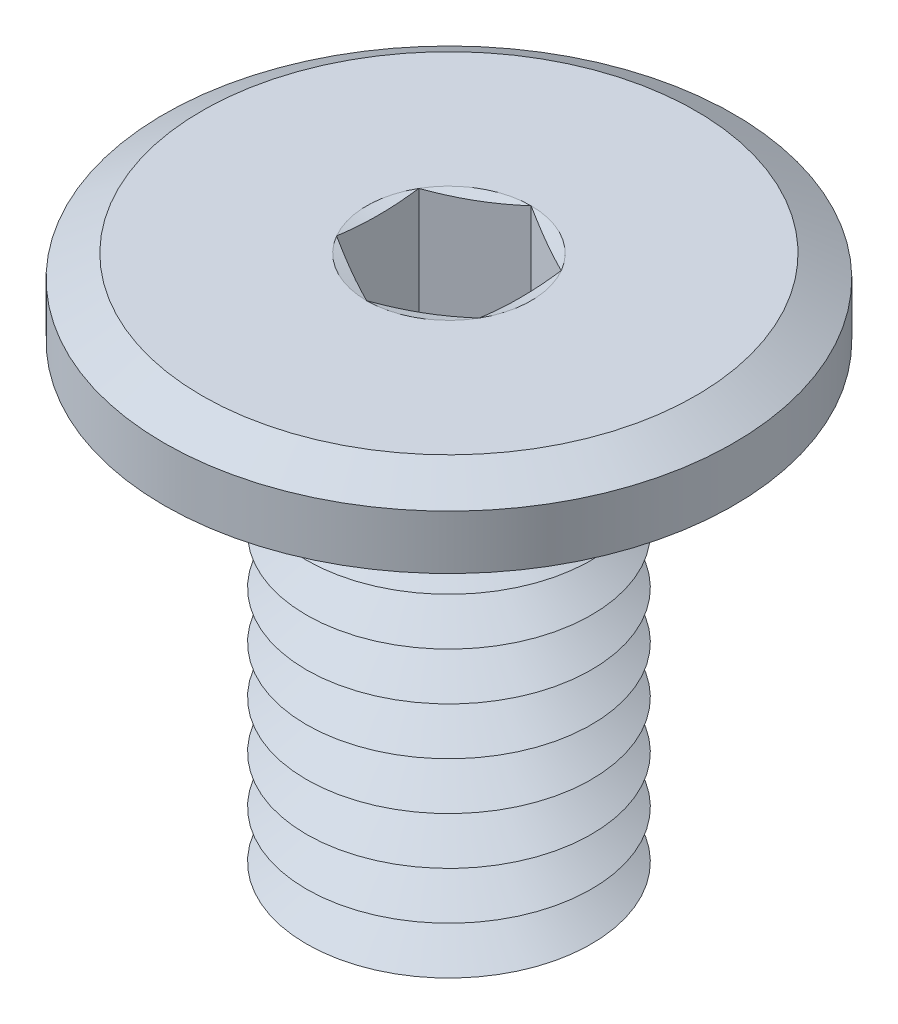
from build123d import *

# Parameters (mm, degrees)
SKETCH1_R           = 3
BOSS_EXTRUDE1_DEPTH = 0.8
SKETCH2_R           = 1.5
BOSS_EXTRUDE2_DEPTH = 5
LPATTERN1_COUNT     = 9
LPATTERN1_PITCH     = 0.5
FILLET1_R           = 0.1
CHAMFER2_SIZE       = 0.4
CHAMFER2_SIZE2      = 0.230940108
CUT_EXTRUDE1_DEPTH  = 1.4


with BuildPart() as part:
    # Sketch1 → Boss-Extrude1 (new body)
    with BuildSketch(Plane(origin=(0, 0, 0), x_dir=(1, 0, 0), z_dir=(0, 1, 0))):
        with Locations(Location((0, 0, 0), (0, 0, 270))):
            Circle(SKETCH1_R)
    extrude(amount=-BOSS_EXTRUDE1_DEPTH)

    # Sketch2 → Boss-Extrude2 (add)
    with BuildSketch(Plane.XZ.offset(0.8)):
        with Locations(Location((0, 0, 0), (0, 0, 270))):
            Circle(SKETCH2_R)
    extrude(amount=BOSS_EXTRUDE2_DEPTH)

    # Sketch5 → Cut-Revolve1 (revolve, cut)
    with BuildSketch(Plane(origin=(0, 0, 0), x_dir=(0, 0, -1), z_dir=(1, 0, 0))):
        Polygon((-1.5, -6.05), (-1.066987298, -5.8), (-1.5, -5.55), align=None)
    cut_revolve1 = revolve(axis=Axis((0, 0.990593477, 0), (0, -1, 0)), mode=Mode.SUBTRACT)

    # LPattern1: Cut-Revolve1 ×9
    with Locations(*[(0, i * LPATTERN1_PITCH, 0) for i in range(1, LPATTERN1_COUNT)]):
        add(cut_revolve1, mode=Mode.SUBTRACT)

    # Fillet1
    fillet1_edges = [part.edges().sort_by_distance(p)[0] for p in [
        (0, -0.8, 1.5),
    ]]
    fillet(fillet1_edges, radius=FILLET1_R)

    # Chamfer2
    chamfer2_edges = [part.edges().sort_by_distance(p)[0] for p in [
        (0, 0, -3),
    ]]
    chamfer2_side = [part.faces().sort_by_distance(p)[0] for p in [
        (0, 0, 0),
    ]]
    chamfer(chamfer2_edges, length=CHAMFER2_SIZE, length2=CHAMFER2_SIZE2, reference=chamfer2_side[0])

    # Sketch6 → Cut-Extrude1 (cut)
    with BuildSketch(Plane(origin=(0, 0, 0), x_dir=(1, 0, 0), z_dir=(0, 1, 0))):
        Polygon((0, 0.866025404), (-0.75, 0.433012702), (-0.75, -0.433012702), (0, -0.866025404), (0.75, -0.433012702), (0.75, 0.433012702), align=None)
    extrude(amount=-CUT_EXTRUDE1_DEPTH, mode=Mode.SUBTRACT)

    # Cut-Extrude2 cone 1 section (on through the dimple's axis) → Cut-Extrude2 (revolve, cut)
    with BuildSketch(Plane(origin=(0, -1.4, 0), x_dir=(0, 0, 1), z_dir=(1, 0, 0))):
        Polygon((0, 0), (0.75, 0), (0, 0.433012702), align=None)
    revolve(axis=Axis((0, -1.4, 0), (0, -1, 0)), mode=Mode.SUBTRACT)

    # Cut-Extrude3 cone 1 section (on through the dimple's axis) → Cut-Extrude3 (revolve, cut)
    with BuildSketch(Plane(origin=(0, 0, 0), x_dir=(0, 0, 1), z_dir=(1, 0, 0))):
        Polygon((0, 0), (0.866025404, 0), (0, 0.232050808), align=None)
    revolve(axis=Axis((0, 0, 0), (0, -1, 0)), mode=Mode.SUBTRACT)


solid = part.part
